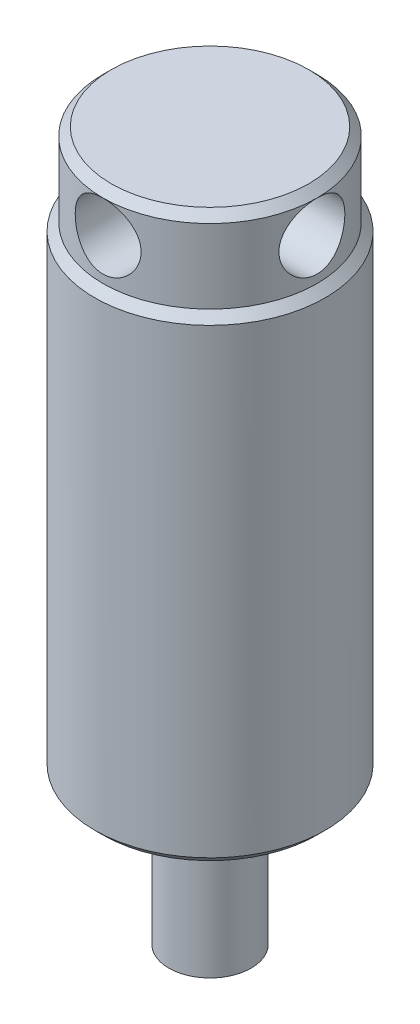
ISO-10303-21;
HEADER;
FILE_DESCRIPTION(('STEP AP214'),'2;1');
FILE_NAME('part.step','',(''),(''),'','','');
FILE_SCHEMA(('AUTOMOTIVE_DESIGN { 1 0 10303 214 1 1 1 1 }'));
ENDSEC;
DATA;
#1=APPLICATION_CONTEXT('core data for automotive mechanical design processes');
#2=APPLICATION_PROTOCOL_DEFINITION('international standard','automotive_design',2000,#1);
#3=PRODUCT_CONTEXT('',#1,'mechanical');
#4=PRODUCT('Part','Part','',(#3));
#5=PRODUCT_RELATED_PRODUCT_CATEGORY('part','',(#4));
#6=PRODUCT_DEFINITION_FORMATION('','',#4);
#7=PRODUCT_DEFINITION_CONTEXT('part definition',#1,'design');
#8=PRODUCT_DEFINITION('design','',#6,#7);
#9=PRODUCT_DEFINITION_SHAPE('','',#8);
#10=(LENGTH_UNIT() NAMED_UNIT(*) SI_UNIT(.MILLI.,.METRE.));
#11=(NAMED_UNIT(*) PLANE_ANGLE_UNIT() SI_UNIT($,.RADIAN.));
#12=(NAMED_UNIT(*) SI_UNIT($,.STERADIAN.) SOLID_ANGLE_UNIT());
#13=UNCERTAINTY_MEASURE_WITH_UNIT(LENGTH_MEASURE(1.E-05),#10,'distance_accuracy_value','');
#14=(GEOMETRIC_REPRESENTATION_CONTEXT(3) GLOBAL_UNCERTAINTY_ASSIGNED_CONTEXT((#13)) GLOBAL_UNIT_ASSIGNED_CONTEXT((#10,
#11,#12)) REPRESENTATION_CONTEXT('',''));
#15=CARTESIAN_POINT('',(0.,0.,0.));
#16=DIRECTION('',(0.,0.,1.));
#17=DIRECTION('',(1.,0.,0.));
#18=AXIS2_PLACEMENT_3D('',#15,#16,#17);
#19=CARTESIAN_POINT('',(0.,40.5,-8.));
#20=DIRECTION('',(0.,0.,1.));
#21=DIRECTION('',(1.,0.,0.));
#22=AXIS2_PLACEMENT_3D('',#19,#20,#21);
#23=CYLINDRICAL_SURFACE('',#22,2.);
#24=CARTESIAN_POINT('',(2.,40.5,6.18465843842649));
#25=CARTESIAN_POINT('',(1.9999990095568,40.3905521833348,6.18465930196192));
#26=CARTESIAN_POINT('',(1.99098535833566,40.2810945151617,6.18759551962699));
#27=CARTESIAN_POINT('',(1.95526805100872,40.0653888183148,6.19897317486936));
#28=CARTESIAN_POINT('',(1.92855917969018,39.9591417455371,6.2074162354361));
#29=CARTESIAN_POINT('',(1.85845185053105,39.753012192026,6.22876273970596));
#30=CARTESIAN_POINT('',(1.81508223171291,39.6531190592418,6.24165847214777));
#31=CARTESIAN_POINT('',(1.71298018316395,39.4620001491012,6.27044669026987));
#32=CARTESIAN_POINT('',(1.65424519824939,39.3707758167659,6.28633967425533));
#33=CARTESIAN_POINT('',(1.52098542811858,39.196546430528,6.31992519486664));
#34=CARTESIAN_POINT('',(1.44603755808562,39.1138725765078,6.33765756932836));
#35=CARTESIAN_POINT('',(1.2833853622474,38.9620462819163,6.37258438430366));
#36=CARTESIAN_POINT('',(1.19567931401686,38.892895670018,6.38977875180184));
#37=CARTESIAN_POINT('',(1.00762969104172,38.7686263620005,6.4221466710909));
#38=CARTESIAN_POINT('',(0.907051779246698,38.7138474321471,6.43726783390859));
#39=CARTESIAN_POINT('',(0.697566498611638,38.6221110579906,6.46332130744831));
#40=CARTESIAN_POINT('',(0.588661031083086,38.5851495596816,6.47425457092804));
#41=CARTESIAN_POINT('',(0.369078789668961,38.5311992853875,6.49041842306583));
#42=CARTESIAN_POINT('',(0.258553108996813,38.513644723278,6.49581021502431));
#43=CARTESIAN_POINT('',(0.0360024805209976,38.4972153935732,6.50085231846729));
#44=CARTESIAN_POINT('',(-0.0760221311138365,38.4983365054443,6.50050389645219));
#45=CARTESIAN_POINT('',(-0.294413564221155,38.5188515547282,6.49421773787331));
#46=CARTESIAN_POINT('',(-0.40084423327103,38.5376324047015,6.48846753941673));
#47=CARTESIAN_POINT('',(-0.6089625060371,38.5919295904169,6.47225351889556));
#48=CARTESIAN_POINT('',(-0.710649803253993,38.6274470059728,6.46178939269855));
#49=CARTESIAN_POINT('',(-0.907825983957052,38.7146112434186,6.43706860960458));
#50=CARTESIAN_POINT('',(-1.00322571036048,38.7664467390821,6.42276789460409));
#51=CARTESIAN_POINT('',(-1.18416561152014,38.8846251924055,6.39188462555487));
#52=CARTESIAN_POINT('',(-1.26970334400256,38.9509717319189,6.37530150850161));
#53=CARTESIAN_POINT('',(-1.43214818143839,39.0994491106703,6.34083036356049));
#54=CARTESIAN_POINT('',(-1.50856604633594,39.1821099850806,6.32291668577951));
#55=CARTESIAN_POINT('',(-1.64659789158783,39.3592439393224,6.28838540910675));
#56=CARTESIAN_POINT('',(-1.70821023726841,39.4537183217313,6.27176795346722));
#57=CARTESIAN_POINT('',(-1.81542815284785,39.6531430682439,6.24158384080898));
#58=CARTESIAN_POINT('',(-1.86085804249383,39.7581934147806,6.22805120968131));
#59=CARTESIAN_POINT('',(-1.93323233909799,39.9749687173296,6.20596978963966));
#60=CARTESIAN_POINT('',(-1.96018314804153,40.0866913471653,6.19741927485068));
#61=CARTESIAN_POINT('',(-1.99390183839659,40.3089645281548,6.18665163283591));
#62=CARTESIAN_POINT('',(-2.00141677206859,40.4193904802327,6.18420022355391));
#63=CARTESIAN_POINT('',(-1.99814331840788,40.6399313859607,6.18525890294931));
#64=CARTESIAN_POINT('',(-1.98735765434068,40.7500463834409,6.18876810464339));
#65=CARTESIAN_POINT('',(-1.94845591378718,40.9636626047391,6.20112183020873));
#66=CARTESIAN_POINT('',(-1.92082922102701,41.0672625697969,6.2098155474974));
#67=CARTESIAN_POINT('',(-1.84960144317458,41.2683468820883,6.23140033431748));
#68=CARTESIAN_POINT('',(-1.80599780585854,41.3658302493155,6.24429207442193));
#69=CARTESIAN_POINT('',(-1.70266083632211,41.5549309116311,6.27326823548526));
#70=CARTESIAN_POINT('',(-1.642510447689,41.6463078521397,6.28943187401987));
#71=CARTESIAN_POINT('',(-1.50827755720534,41.8179435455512,6.32296420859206));
#72=CARTESIAN_POINT('',(-1.43419154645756,41.8981994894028,6.34033320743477));
#73=CARTESIAN_POINT('',(-1.27066455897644,42.0486245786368,6.37515982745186));
#74=CARTESIAN_POINT('',(-1.18072798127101,42.1182619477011,6.39259321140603));
#75=CARTESIAN_POINT('',(-0.990026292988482,42.2414740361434,6.4248880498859));
#76=CARTESIAN_POINT('',(-0.889261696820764,42.2950495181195,6.43974962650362));
#77=CARTESIAN_POINT('',(-0.680404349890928,42.3841011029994,6.46513895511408));
#78=CARTESIAN_POINT('',(-0.572372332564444,42.4197101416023,6.47569842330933));
#79=CARTESIAN_POINT('',(-0.351472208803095,42.4721417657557,6.49143353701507));
#80=CARTESIAN_POINT('',(-0.238605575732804,42.4889700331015,6.49661081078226));
#81=CARTESIAN_POINT('',(-0.0161425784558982,42.502912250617,6.50089371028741));
#82=CARTESIAN_POINT('',(0.0934015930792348,42.5007954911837,6.50023627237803));
#83=CARTESIAN_POINT('',(0.310503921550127,42.4787598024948,6.49348761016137));
#84=CARTESIAN_POINT('',(0.418062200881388,42.4588419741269,6.48739672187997));
#85=CARTESIAN_POINT('',(0.626896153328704,42.4022541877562,6.47053765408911));
#86=CARTESIAN_POINT('',(0.72823100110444,42.3657847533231,6.45982553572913));
#87=CARTESIAN_POINT('',(0.923394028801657,42.2773093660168,6.43482974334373));
#88=CARTESIAN_POINT('',(1.01722093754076,42.2253007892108,6.4205454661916));
#89=CARTESIAN_POINT('',(1.19809140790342,42.1052252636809,6.38931014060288));
#90=CARTESIAN_POINT('',(1.28480651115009,42.036682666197,6.37228632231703));
#91=CARTESIAN_POINT('',(1.44576009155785,41.8863305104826,6.33770998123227));
#92=CARTESIAN_POINT('',(1.51999487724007,41.8045170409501,6.32015730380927));
#93=CARTESIAN_POINT('',(1.65626040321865,41.626823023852,6.28584951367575));
#94=CARTESIAN_POINT('',(1.71782754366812,41.5305776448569,6.26913756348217));
#95=CARTESIAN_POINT('',(1.82384213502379,41.3286092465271,6.23912274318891));
#96=CARTESIAN_POINT('',(1.86829702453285,41.2228903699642,6.22581839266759));
#97=CARTESIAN_POINT('',(1.93528263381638,41.0152118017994,6.20530356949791));
#98=CARTESIAN_POINT('',(1.95948210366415,40.9138336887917,6.19763764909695));
#99=CARTESIAN_POINT('',(1.99183943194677,40.7083062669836,6.18731524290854));
#100=CARTESIAN_POINT('',(2.00000094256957,40.6041575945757,6.18465761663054));
#101=CARTESIAN_POINT('',(2.,40.5,6.18465843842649));
#102=B_SPLINE_CURVE_WITH_KNOTS('',3,(#24,#25,#26,#27,#28,#29,#30,#31,#32,#33,#34,#35,#36,#37,
#38,#39,#40,#41,#42,#43,#44,#45,#46,#47,#48,#49,#50,#51,#52,#53,#54,#55,#56,#57,#58,#59,#60,#61,
#62,#63,#64,#65,#66,#67,#68,#69,#70,#71,#72,#73,#74,#75,#76,#77,#78,#79,#80,#81,#82,#83,#84,#85,
#86,#87,#88,#89,#90,#91,#92,#93,#94,#95,#96,#97,#98,#99,#100,#101),.UNSPECIFIED.,.T.,.F.,(4,2,2,
2,2,2,2,2,2,2,2,2,2,2,2,2,2,2,2,2,2,2,2,2,2,2,2,2,2,2,2,2,2,2,2,2,2,2,4),(0.,0.327958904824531,
0.656014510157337,0.983504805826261,1.31104959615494,1.64848092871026,1.9859578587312,
2.33081172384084,2.67558708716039,3.0100217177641,3.34438256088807,3.66754797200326,
3.9907342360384,4.31780371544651,4.64495401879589,4.98534121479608,5.32576597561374,
5.66978125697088,6.01367729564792,6.34414407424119,6.67456168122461,6.99580726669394,
7.31710419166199,7.64738828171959,7.97775564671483,8.32133560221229,8.66489924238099,
9.00588210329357,9.34676177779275,9.67386437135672,10.0009467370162,10.3241681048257,
10.6474440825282,10.9814486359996,11.3155518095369,11.6602881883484,12.0048745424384,
12.3170524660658,12.6291592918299),.UNSPECIFIED.);
#103=CARTESIAN_POINT('',(0.,42.5,6.5));
#104=VERTEX_POINT('',#103);
#105=EDGE_CURVE('E431',#104,#104,#102,.T.);
#106=ORIENTED_EDGE('',*,*,#105,.F.);
#107=EDGE_LOOP('',(#106));
#108=FACE_BOUND('',#107,.T.);
#109=CARTESIAN_POINT('',(0.,40.5,0.));
#110=DIRECTION('',(-0.707106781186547,0.,0.707106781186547));
#111=DIRECTION('',(0.707106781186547,0.,0.707106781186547));
#112=AXIS2_PLACEMENT_3D('',#109,#110,#111);
#113=ELLIPSE('',#112,2.82842712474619,2.);
#114=CARTESIAN_POINT('',(0.,42.5,0.));
#115=VERTEX_POINT('',#114);
#116=CARTESIAN_POINT('',(0.,38.5,0.));
#117=VERTEX_POINT('',#116);
#118=EDGE_CURVE('E364',#115,#117,#113,.F.);
#119=ORIENTED_EDGE('',*,*,#118,.T.);
#120=CARTESIAN_POINT('',(0.,40.5,0.));
#121=DIRECTION('',(0.707106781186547,0.,0.707106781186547));
#122=DIRECTION('',(-0.707106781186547,0.,0.707106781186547));
#123=AXIS2_PLACEMENT_3D('',#120,#121,#122);
#124=ELLIPSE('',#123,2.82842712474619,2.);
#125=EDGE_CURVE('E11',#117,#115,#124,.F.);
#126=ORIENTED_EDGE('',*,*,#125,.T.);
#127=EDGE_LOOP('',(#119,#126));
#128=FACE_BOUND('',#127,.T.);
#129=ADVANCED_FACE('F351',(#108,#128),#23,.F.);
#130=CARTESIAN_POINT('',(0.,9.,0.));
#131=DIRECTION('',(0.,-1.,0.));
#132=DIRECTION('',(0.,0.,-1.));
#133=AXIS2_PLACEMENT_3D('',#130,#131,#132);
#134=CYLINDRICAL_SURFACE('',#133,2.5);
#135=CARTESIAN_POINT('',(0.,9.,0.));
#136=DIRECTION('',(0.,1.,0.));
#137=DIRECTION('',(0.,0.,1.));
#138=AXIS2_PLACEMENT_3D('',#135,#136,#137);
#139=CIRCLE('',#138,2.5);
#140=CARTESIAN_POINT('',(0.,9.,2.5));
#141=VERTEX_POINT('',#140);
#142=EDGE_CURVE('E415',#141,#141,#139,.T.);
#143=ORIENTED_EDGE('',*,*,#142,.F.);
#144=EDGE_LOOP('',(#143));
#145=FACE_BOUND('',#144,.T.);
#146=CARTESIAN_POINT('',(0.,0.,0.));
#147=DIRECTION('',(0.,1.,0.));
#148=DIRECTION('',(0.,0.,1.));
#149=AXIS2_PLACEMENT_3D('',#146,#147,#148);
#150=CIRCLE('',#149,2.5);
#151=CARTESIAN_POINT('',(0.,0.,2.5));
#152=VERTEX_POINT('',#151);
#153=EDGE_CURVE('E418',#152,#152,#150,.T.);
#154=ORIENTED_EDGE('',*,*,#153,.T.);
#155=EDGE_LOOP('',(#154));
#156=FACE_BOUND('',#155,.T.);
#157=ADVANCED_FACE('F353',(#145,#156),#134,.T.);
#158=CARTESIAN_POINT('',(0.,0.,0.));
#159=DIRECTION('',(0.,1.,0.));
#160=DIRECTION('',(0.,0.,1.));
#161=AXIS2_PLACEMENT_3D('',#158,#159,#160);
#162=PLANE('',#161);
#163=ORIENTED_EDGE('',*,*,#153,.F.);
#164=EDGE_LOOP('',(#163));
#165=FACE_BOUND('',#164,.T.);
#166=ADVANCED_FACE('F470',(#165),#162,.F.);
#167=CARTESIAN_POINT('',(0.,9.,0.));
#168=DIRECTION('',(0.,1.,0.));
#169=DIRECTION('',(0.,0.,1.));
#170=AXIS2_PLACEMENT_3D('',#167,#168,#169);
#171=PLANE('',#170);
#172=CARTESIAN_POINT('',(0.,9.,0.));
#173=DIRECTION('',(0.,1.,0.));
#174=DIRECTION('',(0.,0.,1.));
#175=AXIS2_PLACEMENT_3D('',#172,#173,#174);
#176=CIRCLE('',#175,6.49999999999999);
#177=CARTESIAN_POINT('',(0.,9.,6.49999999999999));
#178=VERTEX_POINT('',#177);
#179=EDGE_CURVE('E393',#178,#178,#176,.F.);
#180=ORIENTED_EDGE('',*,*,#179,.T.);
#181=EDGE_LOOP('',(#180));
#182=FACE_BOUND('',#181,.T.);
#183=ORIENTED_EDGE('',*,*,#142,.T.);
#184=EDGE_LOOP('',(#183));
#185=FACE_BOUND('',#184,.T.);
#186=ADVANCED_FACE('F520',(#182,#185),#171,.F.);
#187=CARTESIAN_POINT('',(0.,38.,0.));
#188=DIRECTION('',(0.,-1.,0.));
#189=DIRECTION('',(0.,0.,-1.));
#190=AXIS2_PLACEMENT_3D('',#187,#188,#189);
#191=CYLINDRICAL_SURFACE('',#190,7.);
#192=CARTESIAN_POINT('',(0.,37.5,0.));
#193=DIRECTION('',(0.,1.,0.));
#194=DIRECTION('',(0.,0.,1.));
#195=AXIS2_PLACEMENT_3D('',#192,#193,#194);
#196=CIRCLE('',#195,7.);
#197=CARTESIAN_POINT('',(0.,37.5,-7.));
#198=VERTEX_POINT('',#197);
#199=EDGE_CURVE('E400',#198,#198,#196,.F.);
#200=CARTESIAN_POINT('',(0.,9.50000000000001,0.));
#201=DIRECTION('',(0.,1.,0.));
#202=DIRECTION('',(0.,0.,1.));
#203=AXIS2_PLACEMENT_3D('',#200,#201,#202);
#204=CIRCLE('',#203,7.);
#205=CARTESIAN_POINT('',(0.,9.50000000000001,-7.));
#206=VERTEX_POINT('',#205);
#207=EDGE_CURVE('E403',#206,#206,#204,.T.);
#208=CARTESIAN_POINT('',(0.,37.5,-7.));
#209=CARTESIAN_POINT('',(0.,37.2083333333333,-7.));
#210=CARTESIAN_POINT('',(0.,36.9166666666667,-7.));
#211=CARTESIAN_POINT('',(0.,36.3333333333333,-7.));
#212=CARTESIAN_POINT('',(0.,36.0416666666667,-7.));
#213=CARTESIAN_POINT('',(0.,35.4583333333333,-7.));
#214=CARTESIAN_POINT('',(0.,35.1666666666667,-7.));
#215=CARTESIAN_POINT('',(0.,34.5833333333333,-7.));
#216=CARTESIAN_POINT('',(0.,34.2916666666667,-7.));
#217=CARTESIAN_POINT('',(0.,33.7083333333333,-7.));
#218=CARTESIAN_POINT('',(0.,33.4166666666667,-7.));
#219=CARTESIAN_POINT('',(0.,32.8333333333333,-7.));
#220=CARTESIAN_POINT('',(0.,32.5416666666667,-7.));
#221=CARTESIAN_POINT('',(0.,31.9583333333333,-7.));
#222=CARTESIAN_POINT('',(0.,31.6666666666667,-7.));
#223=CARTESIAN_POINT('',(0.,31.0833333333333,-7.));
#224=CARTESIAN_POINT('',(0.,30.7916666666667,-7.));
#225=CARTESIAN_POINT('',(0.,30.2083333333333,-7.));
#226=CARTESIAN_POINT('',(0.,29.9166666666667,-7.));
#227=CARTESIAN_POINT('',(0.,29.3333333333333,-7.));
#228=CARTESIAN_POINT('',(0.,29.0416666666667,-7.));
#229=CARTESIAN_POINT('',(0.,28.4583333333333,-7.));
#230=CARTESIAN_POINT('',(0.,28.1666666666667,-7.));
#231=CARTESIAN_POINT('',(0.,27.5833333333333,-7.));
#232=CARTESIAN_POINT('',(0.,27.2916666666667,-7.));
#233=CARTESIAN_POINT('',(0.,26.7083333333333,-7.));
#234=CARTESIAN_POINT('',(0.,26.4166666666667,-7.));
#235=CARTESIAN_POINT('',(0.,25.8333333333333,-7.));
#236=CARTESIAN_POINT('',(0.,25.5416666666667,-7.));
#237=CARTESIAN_POINT('',(0.,24.9583333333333,-7.));
#238=CARTESIAN_POINT('',(0.,24.6666666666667,-7.));
#239=CARTESIAN_POINT('',(0.,24.0833333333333,-7.));
#240=CARTESIAN_POINT('',(0.,23.7916666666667,-7.));
#241=CARTESIAN_POINT('',(0.,23.2083333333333,-7.));
#242=CARTESIAN_POINT('',(0.,22.9166666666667,-7.));
#243=CARTESIAN_POINT('',(0.,22.3333333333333,-7.));
#244=CARTESIAN_POINT('',(0.,22.0416666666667,-7.));
#245=CARTESIAN_POINT('',(0.,21.4583333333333,-7.));
#246=CARTESIAN_POINT('',(0.,21.1666666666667,-7.));
#247=CARTESIAN_POINT('',(0.,20.5833333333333,-7.));
#248=CARTESIAN_POINT('',(0.,20.2916666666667,-7.));
#249=CARTESIAN_POINT('',(0.,19.7083333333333,-7.));
#250=CARTESIAN_POINT('',(0.,19.4166666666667,-7.));
#251=CARTESIAN_POINT('',(0.,18.8333333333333,-7.));
#252=CARTESIAN_POINT('',(0.,18.5416666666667,-7.));
#253=CARTESIAN_POINT('',(0.,17.9583333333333,-7.));
#254=CARTESIAN_POINT('',(0.,17.6666666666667,-7.));
#255=CARTESIAN_POINT('',(0.,17.0833333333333,-7.));
#256=CARTESIAN_POINT('',(0.,16.7916666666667,-7.));
#257=CARTESIAN_POINT('',(0.,16.2083333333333,-7.));
#258=CARTESIAN_POINT('',(0.,15.9166666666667,-7.));
#259=CARTESIAN_POINT('',(0.,15.3333333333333,-7.));
#260=CARTESIAN_POINT('',(0.,15.0416666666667,-7.));
#261=CARTESIAN_POINT('',(0.,14.4583333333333,-7.));
#262=CARTESIAN_POINT('',(0.,14.1666666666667,-7.));
#263=CARTESIAN_POINT('',(0.,13.5833333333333,-7.));
#264=CARTESIAN_POINT('',(0.,13.2916666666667,-7.));
#265=CARTESIAN_POINT('',(0.,12.7083333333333,-7.));
#266=CARTESIAN_POINT('',(0.,12.4166666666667,-7.));
#267=CARTESIAN_POINT('',(0.,11.8333333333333,-7.));
#268=CARTESIAN_POINT('',(0.,11.5416666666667,-7.));
#269=CARTESIAN_POINT('',(0.,10.9583333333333,-7.));
#270=CARTESIAN_POINT('',(0.,10.6666666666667,-7.));
#271=CARTESIAN_POINT('',(0.,10.0833333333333,-7.));
#272=CARTESIAN_POINT('',(0.,9.79166666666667,-7.));
#273=CARTESIAN_POINT('',(0.,9.50000000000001,-7.));
#274=B_SPLINE_CURVE_WITH_KNOTS('',3,(#208,#209,#210,#211,#212,#213,#214,#215,#216,#217,#218,
#219,#220,#221,#222,#223,#224,#225,#226,#227,#228,#229,#230,#231,#232,#233,#234,#235,#236,#237,
#238,#239,#240,#241,#242,#243,#244,#245,#246,#247,#248,#249,#250,#251,#252,#253,#254,#255,#256,
#257,#258,#259,#260,#261,#262,#263,#264,#265,#266,#267,#268,#269,#270,#271,#272,#273),
.UNSPECIFIED.,.F.,.F.,(4,2,2,2,2,2,2,2,2,2,2,2,2,2,2,2,2,2,2,2,2,2,2,2,2,2,2,2,2,2,2,2,4),(0.,
0.875000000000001,1.75,2.625,3.5,4.375,5.25,6.125,7.,7.875,8.75,9.625,10.5,11.375,12.25,13.125,
14.,14.875,15.75,16.625,17.5,18.375,19.25,20.125,21.,21.875,22.75,23.625,24.5,25.375,26.25,
27.125,28.),.UNSPECIFIED.);
#275=EDGE_CURVE('BSEAM463',#198,#206,#274,.T.);
#276=ORIENTED_EDGE('',*,*,#199,.T.);
#277=ORIENTED_EDGE('',*,*,#207,.T.);
#278=ORIENTED_EDGE('',*,*,#275,.T.);
#279=ORIENTED_EDGE('',*,*,#275,.F.);
#280=EDGE_LOOP('',(#276,#278,#277,#279));
#281=FACE_BOUND('',#280,.T.);
#282=ADVANCED_FACE('F463',(#281),#191,.T.);
#283=CARTESIAN_POINT('',(0.,43.,0.));
#284=DIRECTION('',(0.,-1.,0.));
#285=DIRECTION('',(0.,0.,-1.));
#286=AXIS2_PLACEMENT_3D('',#283,#284,#285);
#287=CYLINDRICAL_SURFACE('',#286,6.5);
#288=CARTESIAN_POINT('',(0.,42.5,0.));
#289=DIRECTION('',(0.,1.,0.));
#290=DIRECTION('',(0.,0.,1.));
#291=AXIS2_PLACEMENT_3D('',#288,#289,#290);
#292=CIRCLE('',#291,6.5);
#293=CARTESIAN_POINT('',(-6.5,42.5,0.));
#294=VERTEX_POINT('',#293);
#295=EDGE_CURVE('E406',#104,#294,#292,.F.);
#296=ORIENTED_EDGE('',*,*,#295,.T.);
#297=CARTESIAN_POINT('',(-6.18465843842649,40.5,-2.));
#298=CARTESIAN_POINT('',(-6.18465930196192,40.6094478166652,-1.9999990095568));
#299=CARTESIAN_POINT('',(-6.18759551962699,40.7189054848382,-1.99098535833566));
#300=CARTESIAN_POINT('',(-6.19897317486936,40.9346111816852,-1.95526805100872));
#301=CARTESIAN_POINT('',(-6.2074162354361,41.0408582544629,-1.92855917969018));
#302=CARTESIAN_POINT('',(-6.22876273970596,41.246987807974,-1.85845185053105));
#303=CARTESIAN_POINT('',(-6.24165847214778,41.3468809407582,-1.8150822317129));
#304=CARTESIAN_POINT('',(-6.27044669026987,41.5379998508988,-1.71298018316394));
#305=CARTESIAN_POINT('',(-6.28633967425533,41.6292241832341,-1.65424519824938));
#306=CARTESIAN_POINT('',(-6.31992519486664,41.803453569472,-1.52098542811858));
#307=CARTESIAN_POINT('',(-6.33765756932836,41.8861274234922,-1.44603755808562));
#308=CARTESIAN_POINT('',(-6.37258438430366,42.0379537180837,-1.2833853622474));
#309=CARTESIAN_POINT('',(-6.38977875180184,42.107104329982,-1.19567931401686));
#310=CARTESIAN_POINT('',(-6.4221466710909,42.2313736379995,-1.00762969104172));
#311=CARTESIAN_POINT('',(-6.43726783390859,42.2861525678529,-0.907051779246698));
#312=CARTESIAN_POINT('',(-6.46332130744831,42.3778889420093,-0.697566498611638));
#313=CARTESIAN_POINT('',(-6.47425457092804,42.4148504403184,-0.588661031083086));
#314=CARTESIAN_POINT('',(-6.49041842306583,42.4688007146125,-0.369078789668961));
#315=CARTESIAN_POINT('',(-6.49581021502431,42.486355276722,-0.258553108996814));
#316=CARTESIAN_POINT('',(-6.50085231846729,42.5027846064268,-0.0360024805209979));
#317=CARTESIAN_POINT('',(-6.50050389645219,42.5016634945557,0.0760221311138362));
#318=CARTESIAN_POINT('',(-6.49421773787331,42.4811484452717,0.294413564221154));
#319=CARTESIAN_POINT('',(-6.48846753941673,42.4623675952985,0.40084423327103));
#320=CARTESIAN_POINT('',(-6.47225351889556,42.4080704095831,0.608962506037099));
#321=CARTESIAN_POINT('',(-6.46178939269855,42.3725529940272,0.710649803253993));
#322=CARTESIAN_POINT('',(-6.43706860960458,42.2853887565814,0.907825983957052));
#323=CARTESIAN_POINT('',(-6.42276789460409,42.2335532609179,1.00322571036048));
#324=CARTESIAN_POINT('',(-6.39188462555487,42.1153748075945,1.18416561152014));
#325=CARTESIAN_POINT('',(-6.37530150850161,42.0490282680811,1.26970334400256));
#326=CARTESIAN_POINT('',(-6.34083036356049,41.9005508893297,1.43214818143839));
#327=CARTESIAN_POINT('',(-6.32291668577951,41.8178900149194,1.50856604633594));
#328=CARTESIAN_POINT('',(-6.28838540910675,41.6407560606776,1.64659789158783));
#329=CARTESIAN_POINT('',(-6.27176795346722,41.5462816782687,1.70821023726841));
#330=CARTESIAN_POINT('',(-6.24158384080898,41.3468569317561,1.81542815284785));
#331=CARTESIAN_POINT('',(-6.22805120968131,41.2418065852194,1.86085804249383));
#332=CARTESIAN_POINT('',(-6.20596978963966,41.0250312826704,1.93323233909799));
#333=CARTESIAN_POINT('',(-6.19741927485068,40.9133086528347,1.96018314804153));
#334=CARTESIAN_POINT('',(-6.18665163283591,40.6910354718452,1.99390183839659));
#335=CARTESIAN_POINT('',(-6.18420022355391,40.5806095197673,2.00141677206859));
#336=CARTESIAN_POINT('',(-6.18525890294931,40.3600686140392,1.99814331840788));
#337=CARTESIAN_POINT('',(-6.18876810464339,40.2499536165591,1.98735765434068));
#338=CARTESIAN_POINT('',(-6.20112183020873,40.0363373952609,1.94845591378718));
#339=CARTESIAN_POINT('',(-6.2098155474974,39.9327374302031,1.92082922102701));
#340=CARTESIAN_POINT('',(-6.23140033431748,39.7316531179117,1.84960144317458));
#341=CARTESIAN_POINT('',(-6.24429207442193,39.6341697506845,1.80599780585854));
#342=CARTESIAN_POINT('',(-6.27326823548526,39.4450690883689,1.70266083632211));
#343=CARTESIAN_POINT('',(-6.28943187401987,39.3536921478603,1.642510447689));
#344=CARTESIAN_POINT('',(-6.32296420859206,39.1820564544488,1.50827755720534));
#345=CARTESIAN_POINT('',(-6.34033320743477,39.1018005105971,1.43419154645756));
#346=CARTESIAN_POINT('',(-6.37515982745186,38.9513754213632,1.27066455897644));
#347=CARTESIAN_POINT('',(-6.39259321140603,38.8817380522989,1.18072798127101));
#348=CARTESIAN_POINT('',(-6.4248880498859,38.7585259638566,0.990026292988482));
#349=CARTESIAN_POINT('',(-6.43974962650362,38.7049504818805,0.889261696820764));
#350=CARTESIAN_POINT('',(-6.46513895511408,38.6158988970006,0.680404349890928));
#351=CARTESIAN_POINT('',(-6.47569842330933,38.5802898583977,0.572372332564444));
#352=CARTESIAN_POINT('',(-6.49143353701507,38.5278582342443,0.351472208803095));
#353=CARTESIAN_POINT('',(-6.49661081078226,38.5110299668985,0.238605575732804));
#354=CARTESIAN_POINT('',(-6.50089371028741,38.497087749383,0.016142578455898));
#355=CARTESIAN_POINT('',(-6.50023627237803,38.4992045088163,-0.0934015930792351));
#356=CARTESIAN_POINT('',(-6.49348761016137,38.5212401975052,-0.310503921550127));
#357=CARTESIAN_POINT('',(-6.48739672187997,38.5411580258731,-0.418062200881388));
#358=CARTESIAN_POINT('',(-6.47053765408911,38.5977458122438,-0.626896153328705));
#359=CARTESIAN_POINT('',(-6.45982553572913,38.6342152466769,-0.72823100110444));
#360=CARTESIAN_POINT('',(-6.43482974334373,38.7226906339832,-0.923394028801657));
#361=CARTESIAN_POINT('',(-6.4205454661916,38.7746992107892,-1.01722093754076));
#362=CARTESIAN_POINT('',(-6.38931014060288,38.8947747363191,-1.19809140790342));
#363=CARTESIAN_POINT('',(-6.37228632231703,38.963317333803,-1.28480651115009));
#364=CARTESIAN_POINT('',(-6.33770998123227,39.1136694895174,-1.44576009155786));
#365=CARTESIAN_POINT('',(-6.32015730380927,39.1954829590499,-1.51999487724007));
#366=CARTESIAN_POINT('',(-6.28584951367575,39.3731769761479,-1.65626040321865));
#367=CARTESIAN_POINT('',(-6.26913756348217,39.4694223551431,-1.71782754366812));
#368=CARTESIAN_POINT('',(-6.23912274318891,39.6713907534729,-1.82384213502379));
#369=CARTESIAN_POINT('',(-6.22581839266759,39.7771096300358,-1.86829702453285));
#370=CARTESIAN_POINT('',(-6.20530356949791,39.9847881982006,-1.93528263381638));
#371=CARTESIAN_POINT('',(-6.19763764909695,40.0861663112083,-1.95948210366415));
#372=CARTESIAN_POINT('',(-6.18731524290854,40.2916937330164,-1.99183943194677));
#373=CARTESIAN_POINT('',(-6.18465761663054,40.3958424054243,-2.00000094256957));
#374=CARTESIAN_POINT('',(-6.18465843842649,40.5,-2.));
#375=B_SPLINE_CURVE_WITH_KNOTS('',3,(#297,#298,#299,#300,#301,#302,#303,#304,#305,#306,#307,
#308,#309,#310,#311,#312,#313,#314,#315,#316,#317,#318,#319,#320,#321,#322,#323,#324,#325,#326,
#327,#328,#329,#330,#331,#332,#333,#334,#335,#336,#337,#338,#339,#340,#341,#342,#343,#344,#345,
#346,#347,#348,#349,#350,#351,#352,#353,#354,#355,#356,#357,#358,#359,#360,#361,#362,#363,#364,
#365,#366,#367,#368,#369,#370,#371,#372,#373,#374),.UNSPECIFIED.,.T.,.F.,(4,2,2,2,2,2,2,2,2,2,2,
2,2,2,2,2,2,2,2,2,2,2,2,2,2,2,2,2,2,2,2,2,2,2,2,2,2,2,4),(0.,0.327958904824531,
0.656014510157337,0.98350480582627,1.31104959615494,1.64848092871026,1.9859578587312,
2.33081172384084,2.67558708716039,3.0100217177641,3.34438256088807,3.66754797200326,
3.99073423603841,4.31780371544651,4.64495401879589,4.98534121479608,5.32576597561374,
5.66978125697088,6.01367729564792,6.34414407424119,6.67456168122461,6.99580726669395,
7.31710419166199,7.6473882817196,7.97775564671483,8.32133560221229,8.66489924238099,
9.00588210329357,9.34676177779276,9.67386437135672,10.0009467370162,10.3241681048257,
10.6474440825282,10.9814486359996,11.3155518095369,11.6602881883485,12.0048745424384,
12.3170524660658,12.6291592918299),.UNSPECIFIED.);
#376=EDGE_CURVE('E475',#294,#294,#375,.T.);
#377=ORIENTED_EDGE('',*,*,#376,.T.);
#378=CARTESIAN_POINT('',(0.,42.5,-6.5));
#379=VERTEX_POINT('',#378);
#380=EDGE_CURVE('E409',#294,#379,#292,.F.);
#381=ORIENTED_EDGE('',*,*,#380,.T.);
#382=CARTESIAN_POINT('',(0.,42.5,-6.5));
#383=CARTESIAN_POINT('',(-0.10958647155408,42.499999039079,-6.49999929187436));
#384=CARTESIAN_POINT('',(-0.219182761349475,42.4909633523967,-6.49720235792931));
#385=CARTESIAN_POINT('',(-0.435175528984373,42.4551505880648,-6.48631855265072));
#386=CARTESIAN_POINT('',(-0.541571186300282,42.4283690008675,-6.47823033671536));
#387=CARTESIAN_POINT('',(-0.748016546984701,42.3580492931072,-6.45764858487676));
#388=CARTESIAN_POINT('',(-0.848075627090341,42.3145366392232,-6.44516174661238));
#389=CARTESIAN_POINT('',(-1.03947745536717,42.2120967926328,-6.41707535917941));
#390=CARTESIAN_POINT('',(-1.13081890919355,42.1531673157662,-6.40147534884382));
#391=CARTESIAN_POINT('',(-1.30493699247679,42.0197023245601,-6.36829752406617));
#392=CARTESIAN_POINT('',(-1.38741488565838,41.9447875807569,-6.35067760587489));
#393=CARTESIAN_POINT('',(-1.53885708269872,41.782286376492,-6.31569252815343));
#394=CARTESIAN_POINT('',(-1.60781896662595,41.6946976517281,-6.29832741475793));
#395=CARTESIAN_POINT('',(-1.73187276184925,41.5067713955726,-6.2653687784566));
#396=CARTESIAN_POINT('',(-1.78659481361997,41.4061797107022,-6.24982736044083));
#397=CARTESIAN_POINT('',(-1.8782224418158,41.1966660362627,-6.22290748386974));
#398=CARTESIAN_POINT('',(-1.91513254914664,41.0877461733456,-6.21152796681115));
#399=CARTESIAN_POINT('',(-1.96900160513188,40.8680326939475,-6.19466009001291));
#400=CARTESIAN_POINT('',(-1.9865133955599,40.7573874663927,-6.18900890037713));
#401=CARTESIAN_POINT('',(-2.00281555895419,40.5345962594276,-6.1837537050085));
#402=CARTESIAN_POINT('',(-2.00161073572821,40.4224506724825,-6.18414814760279));
#403=CARTESIAN_POINT('',(-1.98094698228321,40.2043849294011,-6.19079569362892));
#404=CARTESIAN_POINT('',(-1.96218684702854,40.0983905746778,-6.19682450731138));
#405=CARTESIAN_POINT('',(-1.90807645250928,39.8911333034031,-6.21369772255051));
#406=CARTESIAN_POINT('',(-1.87272447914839,39.7898708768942,-6.22454262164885));
#407=CARTESIAN_POINT('',(-1.78593221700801,39.593269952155,-6.25000070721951));
#408=CARTESIAN_POINT('',(-1.73426970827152,39.4980365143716,-6.2646654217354));
#409=CARTESIAN_POINT('',(-1.61647725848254,39.3173594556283,-6.29608673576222));
#410=CARTESIAN_POINT('',(-1.55034365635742,39.2319183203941,-6.31284386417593));
#411=CARTESIAN_POINT('',(-1.40204114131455,39.0692956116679,-6.34746551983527));
#412=CARTESIAN_POINT('',(-1.31929416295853,38.9926437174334,-6.36534631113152));
#413=CARTESIAN_POINT('',(-1.14189770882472,38.8541777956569,-6.39954830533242));
#414=CARTESIAN_POINT('',(-1.04724740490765,38.7923648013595,-6.4158693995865));
#415=CARTESIAN_POINT('',(-0.84773292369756,38.6849870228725,-6.44527556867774));
#416=CARTESIAN_POINT('',(-0.742798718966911,38.6395451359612,-6.45833594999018));
#417=CARTESIAN_POINT('',(-0.526280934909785,38.5671137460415,-6.47957102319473));
#418=CARTESIAN_POINT('',(-0.414699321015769,38.5401188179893,-6.48774715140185));
#419=CARTESIAN_POINT('',(-0.192552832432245,38.5062419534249,-6.49806290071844));
#420=CARTESIAN_POINT('',(-0.0821071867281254,38.4986426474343,-6.50041772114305));
#421=CARTESIAN_POINT('',(0.138491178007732,38.501754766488,-6.49946000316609));
#422=CARTESIAN_POINT('',(0.248643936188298,38.5124636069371,-6.49614826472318));
#423=CARTESIAN_POINT('',(0.46278580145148,38.5513104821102,-6.48437074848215));
#424=CARTESIAN_POINT('',(0.566859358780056,38.5790246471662,-6.47603039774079));
#425=CARTESIAN_POINT('',(0.768852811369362,38.6505810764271,-6.45516726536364));
#426=CARTESIAN_POINT('',(0.866771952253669,38.6944253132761,-6.44264397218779));
#427=CARTESIAN_POINT('',(1.05627961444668,38.7981711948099,-6.41433382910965));
#428=CARTESIAN_POINT('',(1.14766081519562,38.8584316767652,-6.39847611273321));
#429=CARTESIAN_POINT('',(1.31925606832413,38.9928668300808,-6.36531333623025));
#430=CARTESIAN_POINT('',(1.39946717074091,39.067045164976,-6.34800789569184));
#431=CARTESIAN_POINT('',(1.54963528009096,39.230583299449,-6.31306645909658));
#432=CARTESIAN_POINT('',(1.61908131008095,39.3204160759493,-6.29544322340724));
#433=CARTESIAN_POINT('',(1.74195487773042,39.5108433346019,-6.26255963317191));
#434=CARTESIAN_POINT('',(1.79538273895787,39.6114375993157,-6.24729923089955));
#435=CARTESIAN_POINT('',(1.88435707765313,39.820278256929,-6.22104126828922));
#436=CARTESIAN_POINT('',(1.9199786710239,39.928490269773,-6.21002584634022));
#437=CARTESIAN_POINT('',(1.97237526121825,40.1497826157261,-6.19358575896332));
#438=CARTESIAN_POINT('',(1.98915714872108,40.262861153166,-6.18815904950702));
#439=CARTESIAN_POINT('',(2.00291323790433,40.4853480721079,-6.18371932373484));
#440=CARTESIAN_POINT('',(2.00072360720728,40.5947000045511,-6.18443554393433));
#441=CARTESIAN_POINT('',(1.97860856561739,40.8113978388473,-6.19154584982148));
#442=CARTESIAN_POINT('',(1.95868393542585,40.9187438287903,-6.19793968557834));
#443=CARTESIAN_POINT('',(1.90221657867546,41.1269374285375,-6.21549850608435));
#444=CARTESIAN_POINT('',(1.86590616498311,41.2278541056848,-6.22659666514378));
#445=CARTESIAN_POINT('',(1.77788001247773,41.4222435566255,-6.25229841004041));
#446=CARTESIAN_POINT('',(1.72616121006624,41.5157148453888,-6.26690269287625));
#447=CARTESIAN_POINT('',(1.60648172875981,41.6964125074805,-6.29866516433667));
#448=CARTESIAN_POINT('',(1.5379775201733,41.7832654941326,-6.31589943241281));
#449=CARTESIAN_POINT('',(1.38763671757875,41.9445140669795,-6.35062263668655));
#450=CARTESIAN_POINT('',(1.30579660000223,42.0189063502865,-6.36811163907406));
#451=CARTESIAN_POINT('',(1.12802317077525,42.1554491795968,-6.40203042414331));
#452=CARTESIAN_POINT('',(1.03172886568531,42.2171435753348,-6.41840990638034));
#453=CARTESIAN_POINT('',(0.829631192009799,42.3233844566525,-6.44764383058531));
#454=CARTESIAN_POINT('',(0.723831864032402,42.367938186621,-6.46049976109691));
#455=CARTESIAN_POINT('',(0.515929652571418,42.4351007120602,-6.48025348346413));
#456=CARTESIAN_POINT('',(0.414403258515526,42.4593694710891,-6.48759534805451));
#457=CARTESIAN_POINT('',(0.208587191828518,42.4918180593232,-6.4974684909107));
#458=CARTESIAN_POINT('',(0.104298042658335,42.5000009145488,-6.50000067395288));
#459=CARTESIAN_POINT('',(0.,42.5,-6.5));
#460=B_SPLINE_CURVE_WITH_KNOTS('',3,(#382,#383,#384,#385,#386,#387,#388,#389,#390,#391,#392,
#393,#394,#395,#396,#397,#398,#399,#400,#401,#402,#403,#404,#405,#406,#407,#408,#409,#410,#411,
#412,#413,#414,#415,#416,#417,#418,#419,#420,#421,#422,#423,#424,#425,#426,#427,#428,#429,#430,
#431,#432,#433,#434,#435,#436,#437,#438,#439,#440,#441,#442,#443,#444,#445,#446,#447,#448,#449,
#450,#451,#452,#453,#454,#455,#456,#457,#458,#459),.UNSPECIFIED.,.T.,.F.,(4,2,2,2,2,2,2,2,2,2,2,
2,2,2,2,2,2,2,2,2,2,2,2,2,2,2,2,2,2,2,2,2,2,2,2,2,2,2,4),(0.,0.328376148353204,
0.656835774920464,0.98479741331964,1.31280767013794,1.64969601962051,1.98664463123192,
2.33162619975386,2.67651996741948,3.01130912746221,3.34601236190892,3.66793485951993,
3.98989062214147,4.31643724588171,4.64306657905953,4.98408507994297,5.32512731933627,
5.66867887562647,6.01212935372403,6.34267966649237,6.67318331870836,6.99576592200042,
7.31838798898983,7.64872325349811,7.97914559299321,8.322234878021,8.66531723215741,
9.00693981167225,9.34843740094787,9.6749627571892,10.0014737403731,10.3234943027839,
10.6455789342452,10.9799294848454,11.3143685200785,11.6592775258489,12.0040405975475,
12.3166287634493,12.6291581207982),.UNSPECIFIED.);
#461=EDGE_CURVE('E424',#379,#379,#460,.T.);
#462=ORIENTED_EDGE('',*,*,#461,.T.);
#463=CARTESIAN_POINT('',(6.5,42.5,0.));
#464=VERTEX_POINT('',#463);
#465=EDGE_CURVE('E411',#379,#464,#292,.F.);
#466=ORIENTED_EDGE('',*,*,#465,.T.);
#467=CARTESIAN_POINT('',(6.18465843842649,40.5,-2.));
#468=CARTESIAN_POINT('',(6.18465930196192,40.3905521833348,-1.9999990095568));
#469=CARTESIAN_POINT('',(6.18759551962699,40.2810945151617,-1.99098535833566));
#470=CARTESIAN_POINT('',(6.19897317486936,40.0653888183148,-1.95526805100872));
#471=CARTESIAN_POINT('',(6.2074162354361,39.9591417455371,-1.92855917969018));
#472=CARTESIAN_POINT('',(6.22876273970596,39.753012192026,-1.85845185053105));
#473=CARTESIAN_POINT('',(6.24165847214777,39.6531190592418,-1.81508223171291));
#474=CARTESIAN_POINT('',(6.27044669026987,39.4620001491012,-1.71298018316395));
#475=CARTESIAN_POINT('',(6.28633967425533,39.3707758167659,-1.65424519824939));
#476=CARTESIAN_POINT('',(6.31992519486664,39.196546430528,-1.52098542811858));
#477=CARTESIAN_POINT('',(6.33765756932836,39.1138725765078,-1.44603755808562));
#478=CARTESIAN_POINT('',(6.37258438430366,38.9620462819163,-1.2833853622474));
#479=CARTESIAN_POINT('',(6.38977875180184,38.892895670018,-1.19567931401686));
#480=CARTESIAN_POINT('',(6.4221466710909,38.7686263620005,-1.00762969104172));
#481=CARTESIAN_POINT('',(6.43726783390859,38.7138474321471,-0.907051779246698));
#482=CARTESIAN_POINT('',(6.46332130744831,38.6221110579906,-0.697566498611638));
#483=CARTESIAN_POINT('',(6.47425457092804,38.5851495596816,-0.588661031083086));
#484=CARTESIAN_POINT('',(6.49041842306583,38.5311992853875,-0.369078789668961));
#485=CARTESIAN_POINT('',(6.49581021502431,38.513644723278,-0.258553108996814));
#486=CARTESIAN_POINT('',(6.50085231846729,38.4972153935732,-0.0360024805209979));
#487=CARTESIAN_POINT('',(6.50050389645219,38.4983365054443,0.0760221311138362));
#488=CARTESIAN_POINT('',(6.49421773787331,38.5188515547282,0.294413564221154));
#489=CARTESIAN_POINT('',(6.48846753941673,38.5376324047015,0.40084423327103));
#490=CARTESIAN_POINT('',(6.47225351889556,38.5919295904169,0.608962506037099));
#491=CARTESIAN_POINT('',(6.46178939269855,38.6274470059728,0.710649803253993));
#492=CARTESIAN_POINT('',(6.43706860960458,38.7146112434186,0.907825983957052));
#493=CARTESIAN_POINT('',(6.42276789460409,38.7664467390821,1.00322571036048));
#494=CARTESIAN_POINT('',(6.39188462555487,38.8846251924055,1.18416561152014));
#495=CARTESIAN_POINT('',(6.37530150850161,38.9509717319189,1.26970334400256));
#496=CARTESIAN_POINT('',(6.34083036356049,39.0994491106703,1.43214818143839));
#497=CARTESIAN_POINT('',(6.32291668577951,39.1821099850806,1.50856604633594));
#498=CARTESIAN_POINT('',(6.28838540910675,39.3592439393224,1.64659789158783));
#499=CARTESIAN_POINT('',(6.27176795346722,39.4537183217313,1.70821023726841));
#500=CARTESIAN_POINT('',(6.24158384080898,39.6531430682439,1.81542815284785));
#501=CARTESIAN_POINT('',(6.22805120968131,39.7581934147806,1.86085804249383));
#502=CARTESIAN_POINT('',(6.20596978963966,39.9749687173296,1.93323233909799));
#503=CARTESIAN_POINT('',(6.19741927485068,40.0866913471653,1.96018314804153));
#504=CARTESIAN_POINT('',(6.18665163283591,40.3089645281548,1.99390183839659));
#505=CARTESIAN_POINT('',(6.18420022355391,40.4193904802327,2.00141677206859));
#506=CARTESIAN_POINT('',(6.18525890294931,40.6399313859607,1.99814331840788));
#507=CARTESIAN_POINT('',(6.18876810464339,40.7500463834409,1.98735765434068));
#508=CARTESIAN_POINT('',(6.20112183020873,40.9636626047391,1.94845591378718));
#509=CARTESIAN_POINT('',(6.2098155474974,41.0672625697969,1.92082922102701));
#510=CARTESIAN_POINT('',(6.23140033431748,41.2683468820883,1.84960144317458));
#511=CARTESIAN_POINT('',(6.24429207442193,41.3658302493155,1.80599780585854));
#512=CARTESIAN_POINT('',(6.27326823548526,41.5549309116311,1.70266083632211));
#513=CARTESIAN_POINT('',(6.28943187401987,41.6463078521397,1.642510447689));
#514=CARTESIAN_POINT('',(6.32296420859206,41.8179435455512,1.50827755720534));
#515=CARTESIAN_POINT('',(6.34033320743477,41.8981994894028,1.43419154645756));
#516=CARTESIAN_POINT('',(6.37515982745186,42.0486245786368,1.27066455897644));
#517=CARTESIAN_POINT('',(6.39259321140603,42.1182619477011,1.18072798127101));
#518=CARTESIAN_POINT('',(6.4248880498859,42.2414740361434,0.990026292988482));
#519=CARTESIAN_POINT('',(6.43974962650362,42.2950495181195,0.889261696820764));
#520=CARTESIAN_POINT('',(6.46513895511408,42.3841011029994,0.680404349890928));
#521=CARTESIAN_POINT('',(6.47569842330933,42.4197101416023,0.572372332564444));
#522=CARTESIAN_POINT('',(6.49143353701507,42.4721417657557,0.351472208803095));
#523=CARTESIAN_POINT('',(6.49661081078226,42.4889700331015,0.238605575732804));
#524=CARTESIAN_POINT('',(6.50089371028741,42.502912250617,0.016142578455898));
#525=CARTESIAN_POINT('',(6.50023627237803,42.5007954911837,-0.0934015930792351));
#526=CARTESIAN_POINT('',(6.49348761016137,42.4787598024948,-0.310503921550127));
#527=CARTESIAN_POINT('',(6.48739672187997,42.4588419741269,-0.418062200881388));
#528=CARTESIAN_POINT('',(6.47053765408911,42.4022541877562,-0.626896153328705));
#529=CARTESIAN_POINT('',(6.45982553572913,42.3657847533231,-0.72823100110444));
#530=CARTESIAN_POINT('',(6.43482974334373,42.2773093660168,-0.923394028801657));
#531=CARTESIAN_POINT('',(6.4205454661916,42.2253007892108,-1.01722093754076));
#532=CARTESIAN_POINT('',(6.38931014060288,42.1052252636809,-1.19809140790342));
#533=CARTESIAN_POINT('',(6.37228632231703,42.036682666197,-1.28480651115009));
#534=CARTESIAN_POINT('',(6.33770998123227,41.8863305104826,-1.44576009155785));
#535=CARTESIAN_POINT('',(6.32015730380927,41.8045170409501,-1.51999487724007));
#536=CARTESIAN_POINT('',(6.28584951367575,41.626823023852,-1.65626040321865));
#537=CARTESIAN_POINT('',(6.26913756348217,41.5305776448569,-1.71782754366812));
#538=CARTESIAN_POINT('',(6.23912274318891,41.3286092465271,-1.82384213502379));
#539=CARTESIAN_POINT('',(6.22581839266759,41.2228903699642,-1.86829702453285));
#540=CARTESIAN_POINT('',(6.20530356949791,41.0152118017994,-1.93528263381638));
#541=CARTESIAN_POINT('',(6.19763764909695,40.9138336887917,-1.95948210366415));
#542=CARTESIAN_POINT('',(6.18731524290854,40.7083062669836,-1.99183943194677));
#543=CARTESIAN_POINT('',(6.18465761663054,40.6041575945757,-2.00000094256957));
#544=CARTESIAN_POINT('',(6.18465843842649,40.5,-2.));
#545=B_SPLINE_CURVE_WITH_KNOTS('',3,(#467,#468,#469,#470,#471,#472,#473,#474,#475,#476,#477,
#478,#479,#480,#481,#482,#483,#484,#485,#486,#487,#488,#489,#490,#491,#492,#493,#494,#495,#496,
#497,#498,#499,#500,#501,#502,#503,#504,#505,#506,#507,#508,#509,#510,#511,#512,#513,#514,#515,
#516,#517,#518,#519,#520,#521,#522,#523,#524,#525,#526,#527,#528,#529,#530,#531,#532,#533,#534,
#535,#536,#537,#538,#539,#540,#541,#542,#543,#544),.UNSPECIFIED.,.T.,.F.,(4,2,2,2,2,2,2,2,2,2,2,
2,2,2,2,2,2,2,2,2,2,2,2,2,2,2,2,2,2,2,2,2,2,2,2,2,2,2,4),(0.,0.327958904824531,
0.656014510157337,0.983504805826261,1.31104959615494,1.64848092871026,1.9859578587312,
2.33081172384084,2.67558708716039,3.0100217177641,3.34438256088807,3.66754797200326,
3.99073423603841,4.31780371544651,4.64495401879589,4.98534121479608,5.32576597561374,
5.66978125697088,6.01367729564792,6.34414407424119,6.67456168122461,6.99580726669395,
7.31710419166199,7.6473882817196,7.97775564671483,8.32133560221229,8.66489924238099,
9.00588210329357,9.34676177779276,9.67386437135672,10.0009467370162,10.3241681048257,
10.6474440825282,10.9814486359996,11.3155518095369,11.6602881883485,12.0048745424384,
12.3170524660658,12.6291592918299),.UNSPECIFIED.);
#546=EDGE_CURVE('E370',#464,#464,#545,.T.);
#547=ORIENTED_EDGE('',*,*,#546,.T.);
#548=EDGE_CURVE('E410',#464,#104,#292,.F.);
#549=ORIENTED_EDGE('',*,*,#548,.T.);
#550=ORIENTED_EDGE('',*,*,#105,.T.);
#551=EDGE_LOOP('',(#296,#377,#381,#462,#466,#547,#549,#550));
#552=FACE_BOUND('',#551,.T.);
#553=CARTESIAN_POINT('',(0.,38.,0.));
#554=DIRECTION('',(0.,1.,0.));
#555=DIRECTION('',(0.,0.,1.));
#556=AXIS2_PLACEMENT_3D('',#553,#554,#555);
#557=CIRCLE('',#556,6.5);
#558=CARTESIAN_POINT('',(0.,38.,6.5));
#559=VERTEX_POINT('',#558);
#560=EDGE_CURVE('E421',#559,#559,#557,.T.);
#561=ORIENTED_EDGE('',*,*,#560,.T.);
#562=EDGE_LOOP('',(#561));
#563=FACE_BOUND('',#562,.T.);
#564=ADVANCED_FACE('F435',(#552,#563),#287,.T.);
#565=CARTESIAN_POINT('',(0.,43.,0.));
#566=DIRECTION('',(0.,1.,0.));
#567=DIRECTION('',(0.,0.,1.));
#568=AXIS2_PLACEMENT_3D('',#565,#566,#567);
#569=PLANE('',#568);
#570=CARTESIAN_POINT('',(0.,43.,0.));
#571=DIRECTION('',(0.,1.,0.));
#572=DIRECTION('',(0.,0.,1.));
#573=AXIS2_PLACEMENT_3D('',#570,#571,#572);
#574=CIRCLE('',#573,6.);
#575=CARTESIAN_POINT('',(0.,43.,6.));
#576=VERTEX_POINT('',#575);
#577=EDGE_CURVE('E412',#576,#576,#574,.T.);
#578=ORIENTED_EDGE('',*,*,#577,.T.);
#579=EDGE_LOOP('',(#578));
#580=FACE_BOUND('',#579,.T.);
#581=ADVANCED_FACE('F455',(#580),#569,.T.);
#582=CARTESIAN_POINT('',(0.,43.,0.));
#583=DIRECTION('',(0.,-1.,0.));
#584=DIRECTION('',(0.,0.,-1.));
#585=AXIS2_PLACEMENT_3D('',#582,#583,#584);
#586=CONICAL_SURFACE('',#585,6.,0.785398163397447);
#587=ORIENTED_EDGE('',*,*,#295,.F.);
#588=ORIENTED_EDGE('',*,*,#548,.F.);
#589=ORIENTED_EDGE('',*,*,#465,.F.);
#590=ORIENTED_EDGE('',*,*,#380,.F.);
#591=EDGE_LOOP('',(#587,#588,#589,#590));
#592=FACE_BOUND('',#591,.T.);
#593=ORIENTED_EDGE('',*,*,#577,.F.);
#594=EDGE_LOOP('',(#593));
#595=FACE_BOUND('',#594,.T.);
#596=ADVANCED_FACE('F452',(#592,#595),#586,.T.);
#597=CARTESIAN_POINT('',(0.,38.,0.));
#598=DIRECTION('',(0.,-1.,0.));
#599=DIRECTION('',(0.,0.,-1.));
#600=AXIS2_PLACEMENT_3D('',#597,#598,#599);
#601=CONICAL_SURFACE('',#600,6.5,0.785398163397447);
#602=ORIENTED_EDGE('',*,*,#199,.F.);
#603=EDGE_LOOP('',(#602));
#604=FACE_BOUND('',#603,.T.);
#605=ORIENTED_EDGE('',*,*,#560,.F.);
#606=EDGE_LOOP('',(#605));
#607=FACE_BOUND('',#606,.T.);
#608=ADVANCED_FACE('F448',(#604,#607),#601,.T.);
#609=CARTESIAN_POINT('',(0.,9.50000000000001,0.));
#610=DIRECTION('',(0.,1.,0.));
#611=DIRECTION('',(0.,0.,1.));
#612=AXIS2_PLACEMENT_3D('',#609,#610,#611);
#613=CONICAL_SURFACE('',#612,7.,0.78539816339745);
#614=ORIENTED_EDGE('',*,*,#179,.F.);
#615=EDGE_LOOP('',(#614));
#616=FACE_BOUND('',#615,.T.);
#617=ORIENTED_EDGE('',*,*,#207,.F.);
#618=EDGE_LOOP('',(#617));
#619=FACE_BOUND('',#618,.T.);
#620=ADVANCED_FACE('F443',(#616,#619),#613,.T.);
#621=CARTESIAN_POINT('',(0.,40.5,0.));
#622=DIRECTION('',(-0.707106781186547,0.,0.707106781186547));
#623=DIRECTION('',(0.707106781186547,0.,0.707106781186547));
#624=AXIS2_PLACEMENT_3D('',#621,#622,#623);
#625=ELLIPSE('',#624,2.82842712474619,2.);
#626=EDGE_CURVE('E385',#115,#117,#625,.T.);
#627=ORIENTED_EDGE('',*,*,#626,.T.);
#628=CARTESIAN_POINT('',(0.,40.5,0.));
#629=DIRECTION('',(0.707106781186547,0.,0.707106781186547));
#630=DIRECTION('',(-0.707106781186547,0.,0.707106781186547));
#631=AXIS2_PLACEMENT_3D('',#628,#629,#630);
#632=ELLIPSE('',#631,2.82842712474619,2.);
#633=EDGE_CURVE('E359',#117,#115,#632,.T.);
#634=ORIENTED_EDGE('',*,*,#633,.T.);
#635=EDGE_LOOP('',(#627,#634));
#636=FACE_BOUND('',#635,.T.);
#637=ORIENTED_EDGE('',*,*,#461,.F.);
#638=EDGE_LOOP('',(#637));
#639=FACE_BOUND('',#638,.T.);
#640=ADVANCED_FACE('F395',(#636,#639),#23,.F.);
#641=CARTESIAN_POINT('',(-8.,40.5,0.));
#642=DIRECTION('',(1.,0.,0.));
#643=DIRECTION('',(0.,0.,-1.));
#644=AXIS2_PLACEMENT_3D('',#641,#642,#643);
#645=CYLINDRICAL_SURFACE('',#644,2.);
#646=ORIENTED_EDGE('',*,*,#118,.F.);
#647=ORIENTED_EDGE('',*,*,#633,.F.);
#648=EDGE_LOOP('',(#646,#647));
#649=FACE_BOUND('',#648,.T.);
#650=ORIENTED_EDGE('',*,*,#546,.F.);
#651=EDGE_LOOP('',(#650));
#652=FACE_BOUND('',#651,.T.);
#653=ADVANCED_FACE('F392',(#649,#652),#645,.F.);
#654=ORIENTED_EDGE('',*,*,#626,.F.);
#655=ORIENTED_EDGE('',*,*,#125,.F.);
#656=EDGE_LOOP('',(#654,#655));
#657=FACE_BOUND('',#656,.T.);
#658=ORIENTED_EDGE('',*,*,#376,.F.);
#659=EDGE_LOOP('',(#658));
#660=FACE_BOUND('',#659,.T.);
#661=ADVANCED_FACE('F386',(#657,#660),#645,.F.);
#662=CLOSED_SHELL('',(#129,#157,#166,#186,#282,#564,#581,#596,#608,#620,#640,#653,#661));
#663=MANIFOLD_SOLID_BREP('B2',#662);
#664=ADVANCED_BREP_SHAPE_REPRESENTATION('',(#18,#663),#14);
#665=SHAPE_DEFINITION_REPRESENTATION(#9,#664);
ENDSEC;
END-ISO-10303-21;
